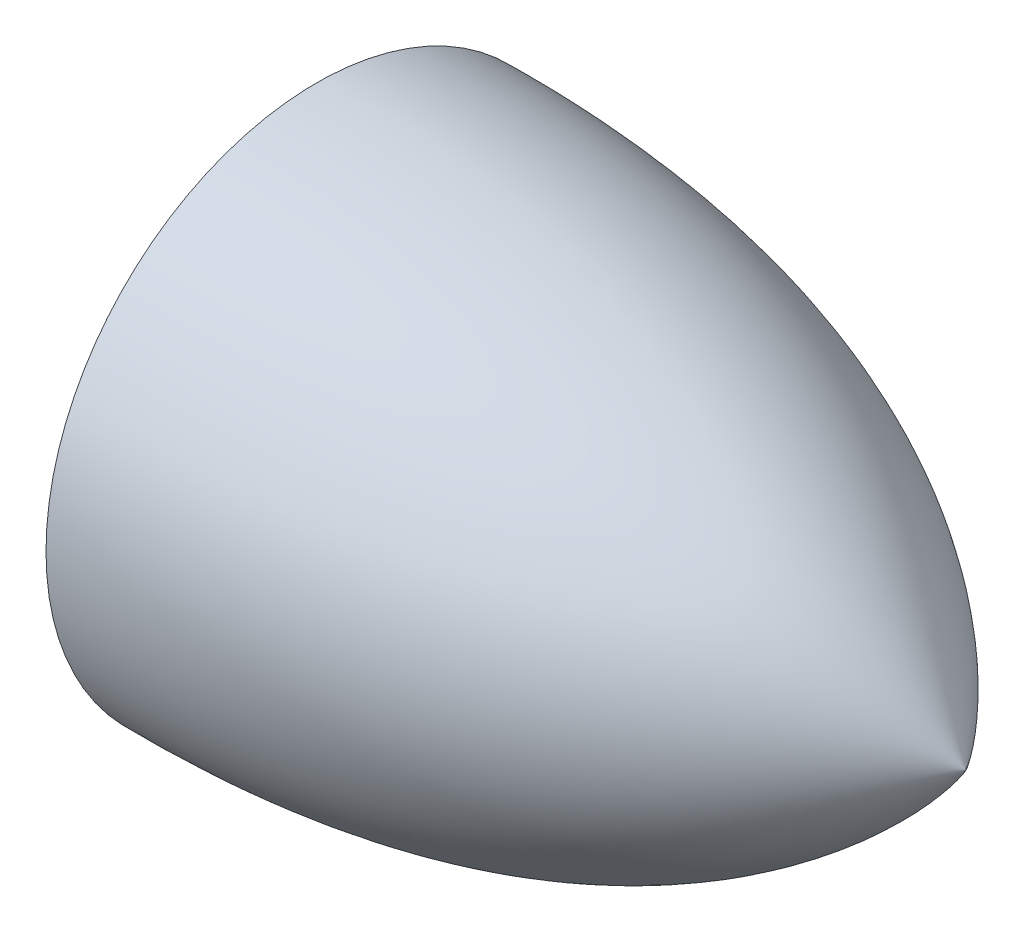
from build123d import *

# Parameters (mm, degrees)
ESQUISSE2_R             = 0.75
ENL_V_MAT_EXTRU_1_DEPTH = 3


with BuildPart() as part:
    # Esquisse1 → R_volution1 (revolve)
    with BuildSketch(Plane(origin=(0, 0, 0), x_dir=(1, 0, 0), z_dir=(0, 1, 0))):
        with BuildLine():
            Line((0, 2.5), (0, 0))
            Line((0, 0), (6, 0))
            add(Edge.make_bspline(
                [(0, 2.5), (4.20094513, 2.547960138), (6, 0)],
                knots=[0, 0, 0, 0.789485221, 0.789485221, 0.789485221], degree=2))
        make_face()
    revolve(axis=Axis((-6.109542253, 0, 0), (1, 0, 0)))

    # Esquisse2 → Enl_v. mat.-Extru.1 (cut)
    with BuildSketch(Plane.ZY):
        Circle(ESQUISSE2_R)
    extrude(amount=-ENL_V_MAT_EXTRU_1_DEPTH, mode=Mode.SUBTRACT)


solid = part.part
